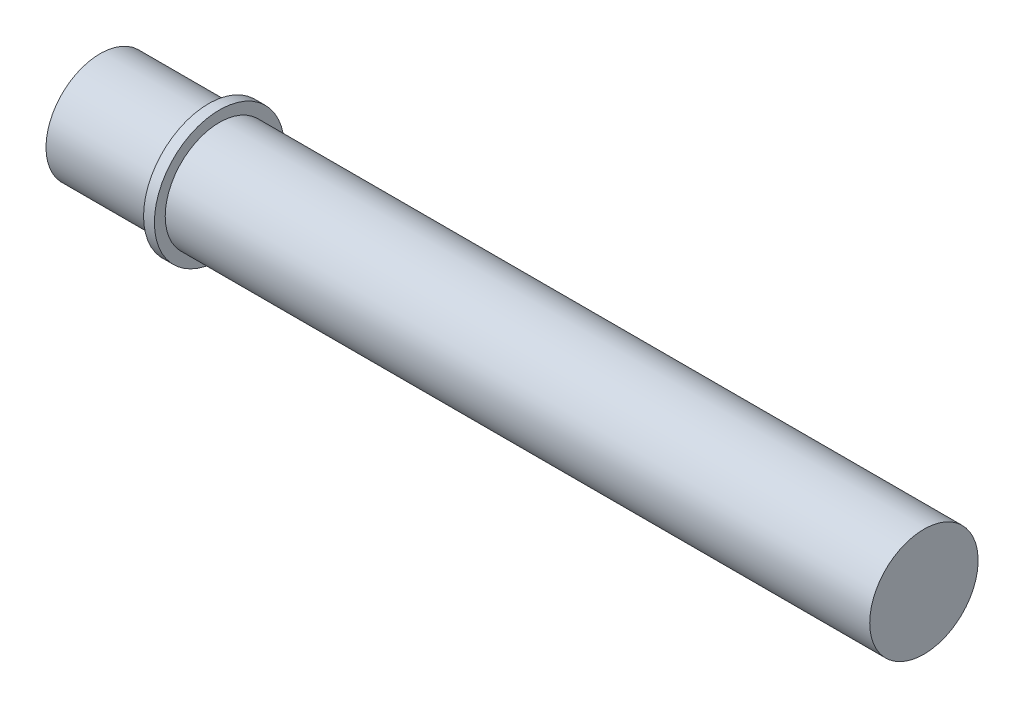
from build123d import *


with BuildPart() as part:
    # Esquisse1 → Base-R_volution (revolve)
    with BuildSketch(Plane.XY, mode=Mode.PRIVATE) as base_r_volution_sk:
        Polygon((0, 0), (0, 5), (10, 5), (10, 6), (11, 6), (11, 5), (76, 5), (76, 0), align=None)
    revolve(base_r_volution_sk.sketch.rotate(Axis((0, 0, 0), (1, 0, 0)), 90), axis=Axis((0, 0, 0), (1, 0, 0)))


solid = part.part
